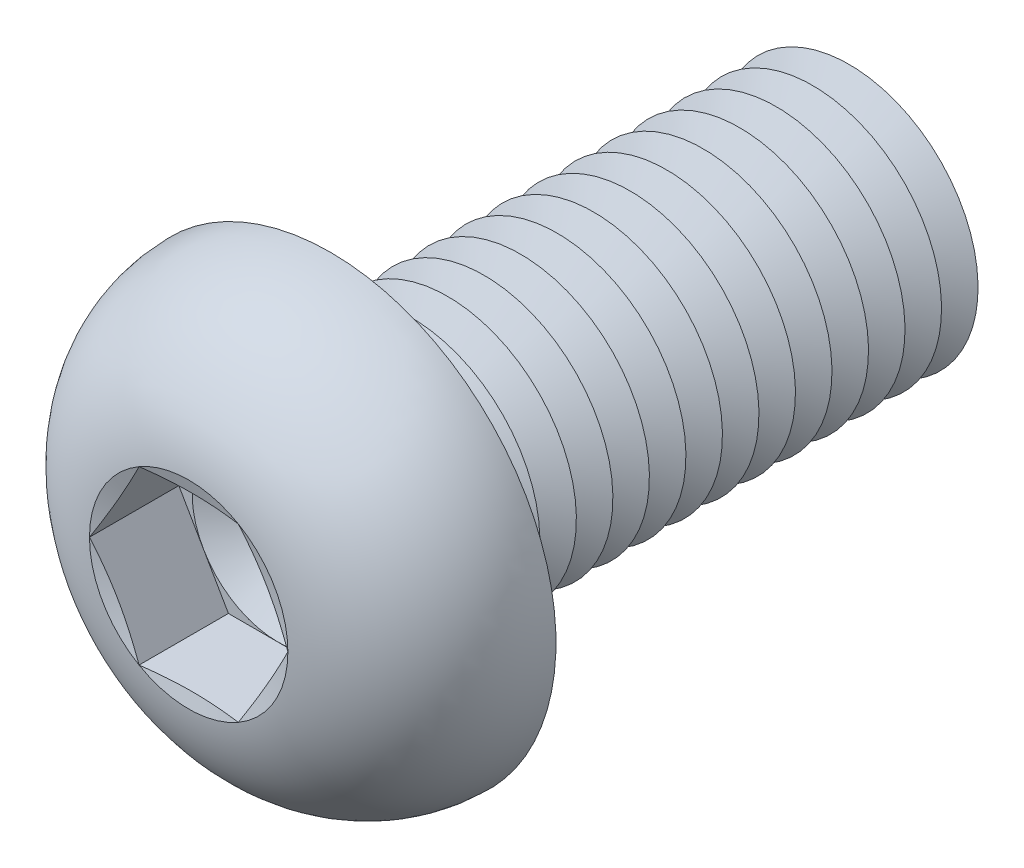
ISO-10303-21;
HEADER;
FILE_DESCRIPTION(('STEP AP214'),'2;1');
FILE_NAME('part.step','',(''),(''),'','','');
FILE_SCHEMA(('AUTOMOTIVE_DESIGN { 1 0 10303 214 1 1 1 1 }'));
ENDSEC;
DATA;
#1=APPLICATION_CONTEXT('core data for automotive mechanical design processes');
#2=APPLICATION_PROTOCOL_DEFINITION('international standard','automotive_design',2000,#1);
#3=PRODUCT_CONTEXT('',#1,'mechanical');
#4=PRODUCT('Part','Part','',(#3));
#5=PRODUCT_RELATED_PRODUCT_CATEGORY('part','',(#4));
#6=PRODUCT_DEFINITION_FORMATION('','',#4);
#7=PRODUCT_DEFINITION_CONTEXT('part definition',#1,'design');
#8=PRODUCT_DEFINITION('design','',#6,#7);
#9=PRODUCT_DEFINITION_SHAPE('','',#8);
#10=(LENGTH_UNIT() NAMED_UNIT(*) SI_UNIT(.MILLI.,.METRE.));
#11=(NAMED_UNIT(*) PLANE_ANGLE_UNIT() SI_UNIT($,.RADIAN.));
#12=(NAMED_UNIT(*) SI_UNIT($,.STERADIAN.) SOLID_ANGLE_UNIT());
#13=UNCERTAINTY_MEASURE_WITH_UNIT(LENGTH_MEASURE(1.E-05),#10,'distance_accuracy_value','');
#14=(GEOMETRIC_REPRESENTATION_CONTEXT(3) GLOBAL_UNCERTAINTY_ASSIGNED_CONTEXT((#13)) GLOBAL_UNIT_ASSIGNED_CONTEXT((#10,
#11,#12)) REPRESENTATION_CONTEXT('',''));
#15=CARTESIAN_POINT('',(0.,0.,0.));
#16=DIRECTION('',(0.,0.,1.));
#17=DIRECTION('',(1.,0.,0.));
#18=AXIS2_PLACEMENT_3D('',#15,#16,#17);
#19=CARTESIAN_POINT('',(0.,0.,2.43999999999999));
#20=DIRECTION('',(0.,0.,1.));
#21=DIRECTION('',(1.,0.,0.));
#22=AXIS2_PLACEMENT_3D('',#19,#20,#21);
#23=PLANE('',#22);
#24=CARTESIAN_POINT('',(0.,0.,2.43999999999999));
#25=DIRECTION('',(0.,0.,1.));
#26=DIRECTION('',(1.,0.,0.));
#27=AXIS2_PLACEMENT_3D('',#24,#25,#26);
#28=CIRCLE('',#27,3.99999813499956);
#29=CARTESIAN_POINT('',(3.4641,1.99999906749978,2.43999999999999));
#30=VERTEX_POINT('',#29);
#31=CARTESIAN_POINT('',(0.,3.99999813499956,2.43999999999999));
#32=VERTEX_POINT('',#31);
#33=EDGE_CURVE('E118',#30,#32,#28,.T.);
#34=ORIENTED_EDGE('',*,*,#33,.F.);
#35=DIRECTION('',(-0.5,0.866025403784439,0.));
#36=VECTOR('',#35,1.);
#37=CARTESIAN_POINT('',(4.6188,0.,2.43999999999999));
#38=LINE('',#37,#36);
#39=CARTESIAN_POINT('',(2.3094,3.99999813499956,2.43999999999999));
#40=VERTEX_POINT('',#39);
#41=EDGE_CURVE('E125',#30,#40,#38,.T.);
#42=ORIENTED_EDGE('',*,*,#41,.T.);
#43=DIRECTION('',(-1.,0.,0.));
#44=VECTOR('',#43,1.);
#45=CARTESIAN_POINT('',(2.3094,3.99999813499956,2.43999999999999));
#46=LINE('',#45,#44);
#47=EDGE_CURVE('E136',#40,#32,#46,.T.);
#48=ORIENTED_EDGE('',*,*,#47,.T.);
#49=EDGE_LOOP('',(#34,#42,#48));
#50=FACE_BOUND('',#49,.T.);
#51=ADVANCED_FACE('F39',(#50),#23,.T.);
#52=CARTESIAN_POINT('',(0.,0.,2.43999999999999));
#53=DIRECTION('',(0.,0.,1.));
#54=DIRECTION('',(1.,0.,0.));
#55=AXIS2_PLACEMENT_3D('',#52,#53,#54);
#56=CIRCLE('',#55,3.99999813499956);
#57=CARTESIAN_POINT('',(-3.4641,1.99999906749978,2.43999999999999));
#58=VERTEX_POINT('',#57);
#59=EDGE_CURVE('E11',#32,#58,#56,.T.);
#60=ORIENTED_EDGE('',*,*,#59,.F.);
#61=CARTESIAN_POINT('',(-2.3094,3.99999813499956,2.43999999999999));
#62=VERTEX_POINT('',#61);
#63=EDGE_CURVE('E131',#32,#62,#46,.T.);
#64=ORIENTED_EDGE('',*,*,#63,.T.);
#65=DIRECTION('',(-0.5,-0.866025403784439,0.));
#66=VECTOR('',#65,1.);
#67=CARTESIAN_POINT('',(-2.3094,3.99999813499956,2.43999999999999));
#68=LINE('',#67,#66);
#69=EDGE_CURVE('E134',#62,#58,#68,.T.);
#70=ORIENTED_EDGE('',*,*,#69,.T.);
#71=EDGE_LOOP('',(#60,#64,#70));
#72=FACE_BOUND('',#71,.T.);
#73=ADVANCED_FACE('F130',(#72),#23,.T.);
#74=CARTESIAN_POINT('',(-3.4641,-1.99999906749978,2.43999999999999));
#75=VERTEX_POINT('',#74);
#76=EDGE_CURVE('E49',#58,#75,#56,.T.);
#77=ORIENTED_EDGE('',*,*,#76,.F.);
#78=CARTESIAN_POINT('',(-4.6188,0.,2.43999999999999));
#79=VERTEX_POINT('',#78);
#80=EDGE_CURVE('E143',#58,#79,#68,.T.);
#81=ORIENTED_EDGE('',*,*,#80,.T.);
#82=DIRECTION('',(0.5,-0.866025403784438,0.));
#83=VECTOR('',#82,1.);
#84=CARTESIAN_POINT('',(-4.6188,0.,2.43999999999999));
#85=LINE('',#84,#83);
#86=EDGE_CURVE('E152',#79,#75,#85,.T.);
#87=ORIENTED_EDGE('',*,*,#86,.T.);
#88=EDGE_LOOP('',(#77,#81,#87));
#89=FACE_BOUND('',#88,.T.);
#90=ADVANCED_FACE('F385',(#89),#23,.T.);
#91=CARTESIAN_POINT('',(0.,-3.99999813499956,2.43999999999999));
#92=VERTEX_POINT('',#91);
#93=EDGE_CURVE('E371',#75,#92,#56,.T.);
#94=ORIENTED_EDGE('',*,*,#93,.F.);
#95=CARTESIAN_POINT('',(-2.3094,-3.99999813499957,2.43999999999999));
#96=VERTEX_POINT('',#95);
#97=EDGE_CURVE('E151',#75,#96,#85,.T.);
#98=ORIENTED_EDGE('',*,*,#97,.T.);
#99=DIRECTION('',(1.,0.,0.));
#100=VECTOR('',#99,1.);
#101=CARTESIAN_POINT('',(-2.3094,-3.99999813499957,2.43999999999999));
#102=LINE('',#101,#100);
#103=EDGE_CURVE('E157',#96,#92,#102,.T.);
#104=ORIENTED_EDGE('',*,*,#103,.T.);
#105=EDGE_LOOP('',(#94,#98,#104));
#106=FACE_BOUND('',#105,.T.);
#107=ADVANCED_FACE('F379',(#106),#23,.T.);
#108=CARTESIAN_POINT('',(3.4641,-1.99999906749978,2.43999999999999));
#109=VERTEX_POINT('',#108);
#110=EDGE_CURVE('E56',#92,#109,#56,.T.);
#111=ORIENTED_EDGE('',*,*,#110,.F.);
#112=CARTESIAN_POINT('',(2.3094,-3.99999813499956,2.43999999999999));
#113=VERTEX_POINT('',#112);
#114=EDGE_CURVE('E156',#92,#113,#102,.T.);
#115=ORIENTED_EDGE('',*,*,#114,.T.);
#116=DIRECTION('',(0.5,0.866025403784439,0.));
#117=VECTOR('',#116,1.);
#118=CARTESIAN_POINT('',(2.3094,-3.99999813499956,2.43999999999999));
#119=LINE('',#118,#117);
#120=EDGE_CURVE('E162',#113,#109,#119,.T.);
#121=ORIENTED_EDGE('',*,*,#120,.T.);
#122=EDGE_LOOP('',(#111,#115,#121));
#123=FACE_BOUND('',#122,.T.);
#124=ADVANCED_FACE('F454',(#123),#23,.T.);
#125=CARTESIAN_POINT('',(0.,0.,6.59999999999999));
#126=DIRECTION('',(0.,0.,1.));
#127=DIRECTION('',(0.,-1.,0.));
#128=AXIS2_PLACEMENT_3D('',#125,#126,#127);
#129=CONICAL_SURFACE('',#128,4.6188,1.30899693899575);
#130=CARTESIAN_POINT('',(4.61891547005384,-0.000199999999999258,6.60003094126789));
#131=CARTESIAN_POINT('',(4.52300232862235,0.165926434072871,6.57431944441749));
#132=CARTESIAN_POINT('',(4.42691527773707,0.332354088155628,6.55097758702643));
#133=CARTESIAN_POINT('',(4.23440181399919,0.665797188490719,6.50996805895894));
#134=CARTESIAN_POINT('',(4.13797527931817,0.832812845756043,6.49230269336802));
#135=CARTESIAN_POINT('',(3.94536752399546,1.16641926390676,6.46367750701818));
#136=CARTESIAN_POINT('',(3.84918760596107,1.33300776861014,6.45268354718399));
#137=CARTESIAN_POINT('',(3.6567051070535,1.66639723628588,6.4379417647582));
#138=CARTESIAN_POINT('',(3.56040255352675,1.83319815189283,6.43419253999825));
#139=CARTESIAN_POINT('',(3.36779744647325,2.16679998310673,6.43419253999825));
#140=CARTESIAN_POINT('',(3.2714948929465,2.33360089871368,6.4379417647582));
#141=CARTESIAN_POINT('',(3.07901239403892,2.66699036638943,6.45268354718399));
#142=CARTESIAN_POINT('',(2.98283247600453,2.8335788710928,6.46367750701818));
#143=CARTESIAN_POINT('',(2.79022472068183,3.16718528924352,6.49230269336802));
#144=CARTESIAN_POINT('',(2.69379818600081,3.33420094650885,6.50996805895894));
#145=CARTESIAN_POINT('',(2.50128472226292,3.66764404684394,6.55097758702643));
#146=CARTESIAN_POINT('',(2.40519767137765,3.83407170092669,6.57431944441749));
#147=CARTESIAN_POINT('',(2.30928452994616,4.00019813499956,6.60003094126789));
#148=B_SPLINE_CURVE_WITH_KNOTS('',3,(#130,#131,#132,#133,#134,#135,#136,#137,#138,#139,#140,
#141,#142,#143,#144,#145,#146,#147),.UNSPECIFIED.,.F.,.F.,(4,2,2,2,2,2,2,2,4),(0.,
0.580655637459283,1.16154676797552,1.73943971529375,2.31722080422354,2.89500189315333,
3.47289484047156,4.05378597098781,4.63444160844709),.UNSPECIFIED.);
#149=CARTESIAN_POINT('',(4.6188,0.,6.59999999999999));
#150=VERTEX_POINT('',#149);
#151=CARTESIAN_POINT('',(2.3094,3.99999813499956,6.59999999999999));
#152=VERTEX_POINT('',#151);
#153=EDGE_CURVE('E222',#150,#152,#148,.T.);
#154=ORIENTED_EDGE('',*,*,#153,.F.);
#155=CARTESIAN_POINT('',(0.,0.,6.59999999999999));
#156=DIRECTION('',(0.,0.,-1.));
#157=DIRECTION('',(0.,1.,0.));
#158=AXIS2_PLACEMENT_3D('',#155,#156,#157);
#159=CIRCLE('',#158,4.6188);
#160=EDGE_CURVE('E350',#152,#150,#159,.T.);
#161=ORIENTED_EDGE('',*,*,#160,.F.);
#162=EDGE_LOOP('',(#154,#161));
#163=FACE_BOUND('',#162,.T.);
#164=ADVANCED_FACE('F458',(#163),#129,.F.);
#165=CARTESIAN_POINT('',(2.30928452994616,-4.00019813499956,6.60003094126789));
#166=CARTESIAN_POINT('',(2.40519767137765,-3.83407170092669,6.57431944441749));
#167=CARTESIAN_POINT('',(2.50128472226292,-3.66764404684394,6.55097758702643));
#168=CARTESIAN_POINT('',(2.69379818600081,-3.33420094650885,6.50996805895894));
#169=CARTESIAN_POINT('',(2.79022472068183,-3.16718528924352,6.49230269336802));
#170=CARTESIAN_POINT('',(2.98283247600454,-2.8335788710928,6.46367750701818));
#171=CARTESIAN_POINT('',(3.07901239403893,-2.66699036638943,6.45268354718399));
#172=CARTESIAN_POINT('',(3.2714948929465,-2.33360089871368,6.4379417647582));
#173=CARTESIAN_POINT('',(3.36779744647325,-2.16679998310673,6.43419253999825));
#174=CARTESIAN_POINT('',(3.56040255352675,-1.83319815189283,6.43419253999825));
#175=CARTESIAN_POINT('',(3.6567051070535,-1.66639723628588,6.43794176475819));
#176=CARTESIAN_POINT('',(3.84918760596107,-1.33300776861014,6.45268354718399));
#177=CARTESIAN_POINT('',(3.94536752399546,-1.16641926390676,6.46367750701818));
#178=CARTESIAN_POINT('',(4.13797527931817,-0.832812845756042,6.49230269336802));
#179=CARTESIAN_POINT('',(4.23440181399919,-0.665797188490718,6.50996805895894));
#180=CARTESIAN_POINT('',(4.42691527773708,-0.332354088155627,6.55097758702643));
#181=CARTESIAN_POINT('',(4.52300232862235,-0.16592643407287,6.57431944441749));
#182=CARTESIAN_POINT('',(4.61891547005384,0.000200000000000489,6.60003094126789));
#183=B_SPLINE_CURVE_WITH_KNOTS('',3,(#165,#166,#167,#168,#169,#170,#171,#172,#173,#174,#175,
#176,#177,#178,#179,#180,#181,#182),.UNSPECIFIED.,.F.,.F.,(4,2,2,2,2,2,2,2,4),(0.,
0.580655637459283,1.16154676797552,1.73943971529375,2.31722080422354,2.89500189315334,
3.47289484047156,4.05378597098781,4.63444160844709),.UNSPECIFIED.);
#184=CARTESIAN_POINT('',(2.3094,-3.99999813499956,6.59999999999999));
#185=VERTEX_POINT('',#184);
#186=EDGE_CURVE('E231',#185,#150,#183,.T.);
#187=ORIENTED_EDGE('',*,*,#186,.F.);
#188=EDGE_CURVE('E355',#150,#185,#159,.T.);
#189=ORIENTED_EDGE('',*,*,#188,.F.);
#190=EDGE_LOOP('',(#187,#189));
#191=FACE_BOUND('',#190,.T.);
#192=ADVANCED_FACE('F420',(#191),#129,.F.);
#193=CARTESIAN_POINT('',(-6.96966750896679,-3.99999813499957,7.51561854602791));
#194=CARTESIAN_POINT('',(-6.80094634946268,-3.99999813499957,7.4764117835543));
#195=CARTESIAN_POINT('',(-6.63214895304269,-3.99999813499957,7.43753277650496));
#196=CARTESIAN_POINT('',(-6.29436999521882,-3.99999813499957,7.36057075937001));
#197=CARTESIAN_POINT('',(-6.12538843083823,-3.99999813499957,7.32248776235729));
#198=CARTESIAN_POINT('',(-5.61806276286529,-3.99999813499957,7.20963087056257));
#199=CARTESIAN_POINT('',(-5.27940301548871,-3.99999813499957,7.1362643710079));
#200=CARTESIAN_POINT('',(-4.5977576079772,-3.99999813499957,6.99431141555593));
#201=CARTESIAN_POINT('',(-4.25476115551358,-3.99999813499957,6.92577621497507));
#202=CARTESIAN_POINT('',(-3.56716783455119,-3.99999813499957,6.79696563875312));
#203=CARTESIAN_POINT('',(-3.22257082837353,-3.99999813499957,6.73669098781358));
#204=CARTESIAN_POINT('',(-2.54069952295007,-3.99999813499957,6.63002020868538));
#205=CARTESIAN_POINT('',(-2.20347918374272,-3.99999813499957,6.58329286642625));
#206=CARTESIAN_POINT('',(-1.6962445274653,-3.99999813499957,6.52585827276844));
#207=CARTESIAN_POINT('',(-1.52694760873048,-3.99999813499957,6.50882377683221));
#208=CARTESIAN_POINT('',(-1.187938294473,-3.99999813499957,6.47963274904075));
#209=CARTESIAN_POINT('',(-1.01822592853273,-3.99999813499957,6.4674758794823));
#210=CARTESIAN_POINT('',(-0.679233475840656,-3.99999813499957,6.44863176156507));
#211=CARTESIAN_POINT('',(-0.509954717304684,-3.99999813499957,6.44192096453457));
#212=CARTESIAN_POINT('',(-0.171265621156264,-3.99999813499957,6.43422163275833));
#213=CARTESIAN_POINT('',(-0.00185528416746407,-3.99999813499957,6.43323307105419));
#214=CARTESIAN_POINT('',(0.336912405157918,-3.99999813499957,6.43703123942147));
#215=CARTESIAN_POINT('',(0.506269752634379,-3.99999813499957,6.44181839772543));
#216=CARTESIAN_POINT('',(0.844732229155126,-3.99999813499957,6.45691823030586));
#217=CARTESIAN_POINT('',(1.01383735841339,-3.99999813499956,6.46723089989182));
#218=CARTESIAN_POINT('',(1.42449950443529,-3.99999813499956,6.49843349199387));
#219=CARTESIAN_POINT('',(1.66585565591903,-3.99999813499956,6.52196685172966));
#220=CARTESIAN_POINT('',(2.14755410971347,-3.99999813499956,6.57749710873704));
#221=CARTESIAN_POINT('',(2.3878964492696,-3.99999813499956,6.60949369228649));
#222=CARTESIAN_POINT('',(2.86835569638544,-3.99999813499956,6.68017769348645));
#223=CARTESIAN_POINT('',(3.10846949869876,-3.99999813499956,6.71888590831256));
#224=CARTESIAN_POINT('',(3.58783416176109,-3.99999813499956,6.80132981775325));
#225=CARTESIAN_POINT('',(3.82708497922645,-3.99999813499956,6.84506576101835));
#226=CARTESIAN_POINT('',(4.30977392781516,-3.99999813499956,6.93726543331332));
#227=CARTESIAN_POINT('',(4.55319689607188,-3.99999813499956,6.98580793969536));
#228=CARTESIAN_POINT('',(5.03943022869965,-3.99999813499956,7.085866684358));
#229=CARTESIAN_POINT('',(5.28224058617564,-3.99999813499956,7.13738295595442));
#230=CARTESIAN_POINT('',(5.76604885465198,-3.99999813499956,7.24238429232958));
#231=CARTESIAN_POINT('',(6.00704943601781,-3.99999813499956,7.29585711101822));
#232=CARTESIAN_POINT('',(6.48863948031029,-3.99999813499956,7.40454827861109));
#233=CARTESIAN_POINT('',(6.72922897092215,-3.99999813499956,7.45976650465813));
#234=CARTESIAN_POINT('',(6.9696675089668,-3.99999813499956,7.51561854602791));
#235=B_SPLINE_CURVE_WITH_KNOTS('',3,(#193,#194,#195,#196,#197,#198,#199,#200,#201,#202,#203,
#204,#205,#206,#207,#208,#209,#210,#211,#212,#213,#214,#215,#216,#217,#218,#219,#220,#221,#222,
#223,#224,#225,#226,#227,#228,#229,#230,#231,#232,#233,#234),.UNSPECIFIED.,.F.,.F.,(4,2,2,2,2,2,
2,2,2,2,2,2,2,2,2,2,2,2,2,2,4),(0.,0.51964933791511,1.03930720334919,2.07882421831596,
3.12808572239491,4.17743921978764,5.19841727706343,5.7088142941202,6.21917596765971,
6.72731891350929,7.23545946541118,7.74363769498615,8.25181549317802,8.97911831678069,
9.70639418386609,10.435965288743,11.1655724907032,11.910195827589,12.6548275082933,
13.395405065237,14.1359306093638),.UNSPECIFIED.);
#236=CARTESIAN_POINT('',(-2.3094,-3.99999813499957,6.59999999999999));
#237=VERTEX_POINT('',#236);
#238=EDGE_CURVE('E399',#237,#185,#235,.T.);
#239=ORIENTED_EDGE('',*,*,#238,.F.);
#240=EDGE_CURVE('E412',#185,#237,#159,.T.);
#241=ORIENTED_EDGE('',*,*,#240,.F.);
#242=EDGE_LOOP('',(#239,#241));
#243=FACE_BOUND('',#242,.T.);
#244=ADVANCED_FACE('F426',(#243),#129,.F.);
#245=CARTESIAN_POINT('',(-4.61891547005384,0.000199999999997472,6.60003094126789));
#246=CARTESIAN_POINT('',(-4.52300232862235,-0.165926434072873,6.57431944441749));
#247=CARTESIAN_POINT('',(-4.42691527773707,-0.33235408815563,6.55097758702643));
#248=CARTESIAN_POINT('',(-4.23440181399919,-0.665797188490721,6.50996805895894));
#249=CARTESIAN_POINT('',(-4.13797527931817,-0.832812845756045,6.49230269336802));
#250=CARTESIAN_POINT('',(-3.94536752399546,-1.16641926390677,6.46367750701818));
#251=CARTESIAN_POINT('',(-3.84918760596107,-1.33300776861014,6.45268354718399));
#252=CARTESIAN_POINT('',(-3.6567051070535,-1.66639723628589,6.4379417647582));
#253=CARTESIAN_POINT('',(-3.56040255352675,-1.83319815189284,6.43419253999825));
#254=CARTESIAN_POINT('',(-3.36779744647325,-2.16679998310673,6.43419253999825));
#255=CARTESIAN_POINT('',(-3.2714948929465,-2.33360089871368,6.4379417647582));
#256=CARTESIAN_POINT('',(-3.07901239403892,-2.66699036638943,6.45268354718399));
#257=CARTESIAN_POINT('',(-2.98283247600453,-2.8335788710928,6.46367750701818));
#258=CARTESIAN_POINT('',(-2.79022472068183,-3.16718528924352,6.49230269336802));
#259=CARTESIAN_POINT('',(-2.69379818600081,-3.33420094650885,6.50996805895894));
#260=CARTESIAN_POINT('',(-2.50128472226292,-3.66764404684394,6.55097758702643));
#261=CARTESIAN_POINT('',(-2.40519767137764,-3.8340717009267,6.57431944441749));
#262=CARTESIAN_POINT('',(-2.30928452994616,-4.00019813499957,6.60003094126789));
#263=B_SPLINE_CURVE_WITH_KNOTS('',3,(#245,#246,#247,#248,#249,#250,#251,#252,#253,#254,#255,
#256,#257,#258,#259,#260,#261,#262),.UNSPECIFIED.,.F.,.F.,(4,2,2,2,2,2,2,2,4),(0.,
0.580655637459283,1.16154676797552,1.73943971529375,2.31722080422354,2.89500189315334,
3.47289484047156,4.05378597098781,4.63444160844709),.UNSPECIFIED.);
#264=CARTESIAN_POINT('',(-4.6188,0.,6.59999999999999));
#265=VERTEX_POINT('',#264);
#266=EDGE_CURVE('E390',#265,#237,#263,.T.);
#267=ORIENTED_EDGE('',*,*,#266,.F.);
#268=EDGE_CURVE('E396',#237,#265,#159,.T.);
#269=ORIENTED_EDGE('',*,*,#268,.F.);
#270=EDGE_LOOP('',(#267,#269));
#271=FACE_BOUND('',#270,.T.);
#272=ADVANCED_FACE('F394',(#271),#129,.F.);
#273=CARTESIAN_POINT('',(-2.30928452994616,4.00019813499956,6.60003094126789));
#274=CARTESIAN_POINT('',(-2.40519767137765,3.83407170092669,6.57431944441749));
#275=CARTESIAN_POINT('',(-2.50128472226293,3.66764404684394,6.55097758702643));
#276=CARTESIAN_POINT('',(-2.69379818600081,3.33420094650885,6.50996805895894));
#277=CARTESIAN_POINT('',(-2.79022472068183,3.16718528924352,6.49230269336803));
#278=CARTESIAN_POINT('',(-2.98283247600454,2.8335788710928,6.46367750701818));
#279=CARTESIAN_POINT('',(-3.07901239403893,2.66699036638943,6.45268354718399));
#280=CARTESIAN_POINT('',(-3.2714948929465,2.33360089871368,6.4379417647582));
#281=CARTESIAN_POINT('',(-3.36779744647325,2.16679998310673,6.43419253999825));
#282=CARTESIAN_POINT('',(-3.56040255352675,1.83319815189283,6.43419253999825));
#283=CARTESIAN_POINT('',(-3.6567051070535,1.66639723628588,6.43794176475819));
#284=CARTESIAN_POINT('',(-3.84918760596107,1.33300776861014,6.45268354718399));
#285=CARTESIAN_POINT('',(-3.94536752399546,1.16641926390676,6.46367750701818));
#286=CARTESIAN_POINT('',(-4.13797527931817,0.832812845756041,6.49230269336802));
#287=CARTESIAN_POINT('',(-4.23440181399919,0.665797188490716,6.50996805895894));
#288=CARTESIAN_POINT('',(-4.42691527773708,0.332354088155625,6.55097758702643));
#289=CARTESIAN_POINT('',(-4.52300232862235,0.165926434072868,6.57431944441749));
#290=CARTESIAN_POINT('',(-4.61891547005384,-0.000200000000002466,6.60003094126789));
#291=B_SPLINE_CURVE_WITH_KNOTS('',3,(#273,#274,#275,#276,#277,#278,#279,#280,#281,#282,#283,
#284,#285,#286,#287,#288,#289,#290),.UNSPECIFIED.,.F.,.F.,(4,2,2,2,2,2,2,2,4),(0.,
0.580655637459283,1.16154676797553,1.73943971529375,2.31722080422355,2.89500189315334,
3.47289484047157,4.05378597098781,4.63444160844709),.UNSPECIFIED.);
#292=CARTESIAN_POINT('',(-2.3094,3.99999813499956,6.59999999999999));
#293=VERTEX_POINT('',#292);
#294=EDGE_CURVE('E195',#293,#265,#291,.T.);
#295=ORIENTED_EDGE('',*,*,#294,.F.);
#296=EDGE_CURVE('E402',#265,#293,#159,.T.);
#297=ORIENTED_EDGE('',*,*,#296,.F.);
#298=EDGE_LOOP('',(#295,#297));
#299=FACE_BOUND('',#298,.T.);
#300=ADVANCED_FACE('F403',(#299),#129,.F.);
#301=CARTESIAN_POINT('',(0.,0.,-19.05));
#302=DIRECTION('',(0.,0.,1.));
#303=DIRECTION('',(0.,-1.,0.));
#304=AXIS2_PLACEMENT_3D('',#301,#302,#303);
#305=CONICAL_SURFACE('',#304,6.,1.0471975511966);
#306=CARTESIAN_POINT('',(0.,0.,-19.9));
#307=DIRECTION('',(0.,0.,1.));
#308=DIRECTION('',(0.,-1.,0.));
#309=AXIS2_PLACEMENT_3D('',#306,#307,#308);
#310=CIRCLE('',#309,4.52775681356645);
#311=CARTESIAN_POINT('',(0.,-4.52775681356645,-19.9));
#312=VERTEX_POINT('',#311);
#313=EDGE_CURVE('E321',#312,#312,#310,.T.);
#314=ORIENTED_EDGE('',*,*,#313,.T.);
#315=EDGE_LOOP('',(#314));
#316=FACE_BOUND('',#315,.T.);
#317=CARTESIAN_POINT('',(0.,0.,-19.05));
#318=DIRECTION('',(0.,0.,1.));
#319=DIRECTION('',(0.,-1.,0.));
#320=AXIS2_PLACEMENT_3D('',#317,#318,#319);
#321=CIRCLE('',#320,6.);
#322=CARTESIAN_POINT('',(0.,-6.,-19.05));
#323=VERTEX_POINT('',#322);
#324=EDGE_CURVE('E317',#323,#323,#321,.T.);
#325=ORIENTED_EDGE('',*,*,#324,.F.);
#326=EDGE_LOOP('',(#325));
#327=FACE_BOUND('',#326,.T.);
#328=ADVANCED_FACE('F486',(#316,#327),#305,.T.);
#329=CARTESIAN_POINT('',(0.,0.,-19.9));
#330=DIRECTION('',(0.,0.,-1.));
#331=DIRECTION('',(0.,1.,0.));
#332=AXIS2_PLACEMENT_3D('',#329,#330,#331);
#333=CONICAL_SURFACE('',#332,4.52775681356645,1.0471975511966);
#334=CARTESIAN_POINT('',(0.,0.,-20.75));
#335=DIRECTION('',(0.,0.,1.));
#336=DIRECTION('',(0.,-1.,0.));
#337=AXIS2_PLACEMENT_3D('',#334,#335,#336);
#338=CIRCLE('',#337,6.);
#339=CARTESIAN_POINT('',(0.,-6.,-20.75));
#340=VERTEX_POINT('',#339);
#341=EDGE_CURVE('E325',#340,#340,#338,.T.);
#342=ORIENTED_EDGE('',*,*,#341,.T.);
#343=EDGE_LOOP('',(#342));
#344=FACE_BOUND('',#343,.T.);
#345=ORIENTED_EDGE('',*,*,#313,.F.);
#346=EDGE_LOOP('',(#345));
#347=FACE_BOUND('',#346,.T.);
#348=ADVANCED_FACE('F491',(#344,#347),#333,.T.);
#349=CARTESIAN_POINT('',(0.,6.00000000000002,-25.));
#350=DIRECTION('',(0.,0.,-1.));
#351=DIRECTION('',(0.,1.,0.));
#352=AXIS2_PLACEMENT_3D('',#349,#350,#351);
#353=PLANE('',#352);
#354=CARTESIAN_POINT('',(0.,0.,-25.));
#355=DIRECTION('',(0.,0.,1.));
#356=DIRECTION('',(0.,-1.,0.));
#357=AXIS2_PLACEMENT_3D('',#354,#355,#356);
#358=CIRCLE('',#357,4.52775681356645);
#359=CARTESIAN_POINT('',(0.,-4.52775681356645,-25.));
#360=VERTEX_POINT('',#359);
#361=EDGE_CURVE('E345',#360,#360,#358,.T.);
#362=ORIENTED_EDGE('',*,*,#361,.F.);
#363=EDGE_LOOP('',(#362));
#364=FACE_BOUND('',#363,.T.);
#365=ADVANCED_FACE('F666',(#364),#353,.T.);
#366=CARTESIAN_POINT('',(0.,0.,-24.15));
#367=DIRECTION('',(0.,0.,1.));
#368=DIRECTION('',(0.,-1.,0.));
#369=AXIS2_PLACEMENT_3D('',#366,#367,#368);
#370=CONICAL_SURFACE('',#369,6.,1.0471975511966);
#371=ORIENTED_EDGE('',*,*,#361,.T.);
#372=EDGE_LOOP('',(#371));
#373=FACE_BOUND('',#372,.T.);
#374=CARTESIAN_POINT('',(0.,0.,-24.15));
#375=DIRECTION('',(0.,0.,1.));
#376=DIRECTION('',(0.,-1.,0.));
#377=AXIS2_PLACEMENT_3D('',#374,#375,#376);
#378=CIRCLE('',#377,6.);
#379=CARTESIAN_POINT('',(0.,-6.,-24.15));
#380=VERTEX_POINT('',#379);
#381=EDGE_CURVE('E341',#380,#380,#378,.T.);
#382=ORIENTED_EDGE('',*,*,#381,.F.);
#383=EDGE_LOOP('',(#382));
#384=FACE_BOUND('',#383,.T.);
#385=ADVANCED_FACE('F659',(#373,#384),#370,.T.);
#386=CARTESIAN_POINT('',(0.,0.,-23.3));
#387=DIRECTION('',(0.,0.,-1.));
#388=DIRECTION('',(0.,1.,0.));
#389=AXIS2_PLACEMENT_3D('',#386,#387,#388);
#390=CONICAL_SURFACE('',#389,4.52775681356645,1.0471975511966);
#391=ORIENTED_EDGE('',*,*,#381,.T.);
#392=EDGE_LOOP('',(#391));
#393=FACE_BOUND('',#392,.T.);
#394=CARTESIAN_POINT('',(0.,0.,-23.3));
#395=DIRECTION('',(0.,0.,1.));
#396=DIRECTION('',(0.,-1.,0.));
#397=AXIS2_PLACEMENT_3D('',#394,#395,#396);
#398=CIRCLE('',#397,4.52775681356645);
#399=CARTESIAN_POINT('',(0.,-4.52775681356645,-23.3));
#400=VERTEX_POINT('',#399);
#401=EDGE_CURVE('E337',#400,#400,#398,.T.);
#402=ORIENTED_EDGE('',*,*,#401,.F.);
#403=EDGE_LOOP('',(#402));
#404=FACE_BOUND('',#403,.T.);
#405=ADVANCED_FACE('F665',(#393,#404),#390,.T.);
#406=CARTESIAN_POINT('',(0.,0.,-22.45));
#407=DIRECTION('',(0.,0.,1.));
#408=DIRECTION('',(0.,-1.,0.));
#409=AXIS2_PLACEMENT_3D('',#406,#407,#408);
#410=CONICAL_SURFACE('',#409,6.,1.0471975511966);
#411=ORIENTED_EDGE('',*,*,#401,.T.);
#412=EDGE_LOOP('',(#411));
#413=FACE_BOUND('',#412,.T.);
#414=CARTESIAN_POINT('',(0.,0.,-22.45));
#415=DIRECTION('',(0.,0.,1.));
#416=DIRECTION('',(0.,-1.,0.));
#417=AXIS2_PLACEMENT_3D('',#414,#415,#416);
#418=CIRCLE('',#417,6.);
#419=CARTESIAN_POINT('',(0.,-6.,-22.45));
#420=VERTEX_POINT('',#419);
#421=EDGE_CURVE('E333',#420,#420,#418,.T.);
#422=ORIENTED_EDGE('',*,*,#421,.F.);
#423=EDGE_LOOP('',(#422));
#424=FACE_BOUND('',#423,.T.);
#425=ADVANCED_FACE('F697',(#413,#424),#410,.T.);
#426=CARTESIAN_POINT('',(0.,0.,-21.6));
#427=DIRECTION('',(0.,0.,-1.));
#428=DIRECTION('',(0.,1.,0.));
#429=AXIS2_PLACEMENT_3D('',#426,#427,#428);
#430=CONICAL_SURFACE('',#429,4.52775681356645,1.0471975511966);
#431=ORIENTED_EDGE('',*,*,#421,.T.);
#432=EDGE_LOOP('',(#431));
#433=FACE_BOUND('',#432,.T.);
#434=CARTESIAN_POINT('',(0.,0.,-21.6));
#435=DIRECTION('',(0.,0.,1.));
#436=DIRECTION('',(0.,-1.,0.));
#437=AXIS2_PLACEMENT_3D('',#434,#435,#436);
#438=CIRCLE('',#437,4.52775681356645);
#439=CARTESIAN_POINT('',(0.,-4.52775681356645,-21.6));
#440=VERTEX_POINT('',#439);
#441=EDGE_CURVE('E329',#440,#440,#438,.T.);
#442=ORIENTED_EDGE('',*,*,#441,.F.);
#443=EDGE_LOOP('',(#442));
#444=FACE_BOUND('',#443,.T.);
#445=ADVANCED_FACE('F707',(#433,#444),#430,.T.);
#446=CARTESIAN_POINT('',(0.,0.,-20.75));
#447=DIRECTION('',(0.,0.,1.));
#448=DIRECTION('',(0.,-1.,0.));
#449=AXIS2_PLACEMENT_3D('',#446,#447,#448);
#450=CONICAL_SURFACE('',#449,6.,1.0471975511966);
#451=ORIENTED_EDGE('',*,*,#441,.T.);
#452=EDGE_LOOP('',(#451));
#453=FACE_BOUND('',#452,.T.);
#454=ORIENTED_EDGE('',*,*,#341,.F.);
#455=EDGE_LOOP('',(#454));
#456=FACE_BOUND('',#455,.T.);
#457=ADVANCED_FACE('F717',(#453,#456),#450,.T.);
#458=CARTESIAN_POINT('',(0.,0.,-17.35));
#459=DIRECTION('',(0.,0.,1.));
#460=DIRECTION('',(0.,-1.,0.));
#461=AXIS2_PLACEMENT_3D('',#458,#459,#460);
#462=CONICAL_SURFACE('',#461,6.,1.0471975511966);
#463=CARTESIAN_POINT('',(0.,0.,-18.2));
#464=DIRECTION('',(0.,0.,1.));
#465=DIRECTION('',(0.,-1.,0.));
#466=AXIS2_PLACEMENT_3D('',#463,#464,#465);
#467=CIRCLE('',#466,4.52775681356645);
#468=CARTESIAN_POINT('',(0.,-4.52775681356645,-18.2));
#469=VERTEX_POINT('',#468);
#470=EDGE_CURVE('E313',#469,#469,#467,.T.);
#471=ORIENTED_EDGE('',*,*,#470,.T.);
#472=EDGE_LOOP('',(#471));
#473=FACE_BOUND('',#472,.T.);
#474=CARTESIAN_POINT('',(0.,0.,-17.35));
#475=DIRECTION('',(0.,0.,1.));
#476=DIRECTION('',(0.,-1.,0.));
#477=AXIS2_PLACEMENT_3D('',#474,#475,#476);
#478=CIRCLE('',#477,6.);
#479=CARTESIAN_POINT('',(0.,-6.,-17.35));
#480=VERTEX_POINT('',#479);
#481=EDGE_CURVE('E309',#480,#480,#478,.T.);
#482=ORIENTED_EDGE('',*,*,#481,.F.);
#483=EDGE_LOOP('',(#482));
#484=FACE_BOUND('',#483,.T.);
#485=ADVANCED_FACE('F727',(#473,#484),#462,.T.);
#486=CARTESIAN_POINT('',(0.,0.,-18.2));
#487=DIRECTION('',(0.,0.,-1.));
#488=DIRECTION('',(0.,1.,0.));
#489=AXIS2_PLACEMENT_3D('',#486,#487,#488);
#490=CONICAL_SURFACE('',#489,4.52775681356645,1.0471975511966);
#491=ORIENTED_EDGE('',*,*,#324,.T.);
#492=EDGE_LOOP('',(#491));
#493=FACE_BOUND('',#492,.T.);
#494=ORIENTED_EDGE('',*,*,#470,.F.);
#495=EDGE_LOOP('',(#494));
#496=FACE_BOUND('',#495,.T.);
#497=ADVANCED_FACE('F737',(#493,#496),#490,.T.);
#498=CARTESIAN_POINT('',(0.,0.,-15.65));
#499=DIRECTION('',(0.,0.,1.));
#500=DIRECTION('',(0.,-1.,0.));
#501=AXIS2_PLACEMENT_3D('',#498,#499,#500);
#502=CONICAL_SURFACE('',#501,6.,1.0471975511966);
#503=CARTESIAN_POINT('',(0.,0.,-16.5));
#504=DIRECTION('',(0.,0.,1.));
#505=DIRECTION('',(0.,-1.,0.));
#506=AXIS2_PLACEMENT_3D('',#503,#504,#505);
#507=CIRCLE('',#506,4.52775681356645);
#508=CARTESIAN_POINT('',(0.,-4.52775681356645,-16.5));
#509=VERTEX_POINT('',#508);
#510=EDGE_CURVE('E305',#509,#509,#507,.T.);
#511=ORIENTED_EDGE('',*,*,#510,.T.);
#512=EDGE_LOOP('',(#511));
#513=FACE_BOUND('',#512,.T.);
#514=CARTESIAN_POINT('',(0.,0.,-15.65));
#515=DIRECTION('',(0.,0.,1.));
#516=DIRECTION('',(0.,-1.,0.));
#517=AXIS2_PLACEMENT_3D('',#514,#515,#516);
#518=CIRCLE('',#517,6.);
#519=CARTESIAN_POINT('',(0.,-6.,-15.65));
#520=VERTEX_POINT('',#519);
#521=EDGE_CURVE('E301',#520,#520,#518,.T.);
#522=ORIENTED_EDGE('',*,*,#521,.F.);
#523=EDGE_LOOP('',(#522));
#524=FACE_BOUND('',#523,.T.);
#525=ADVANCED_FACE('F747',(#513,#524),#502,.T.);
#526=CARTESIAN_POINT('',(0.,0.,-16.5));
#527=DIRECTION('',(0.,0.,-1.));
#528=DIRECTION('',(0.,1.,0.));
#529=AXIS2_PLACEMENT_3D('',#526,#527,#528);
#530=CONICAL_SURFACE('',#529,4.52775681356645,1.0471975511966);
#531=ORIENTED_EDGE('',*,*,#481,.T.);
#532=EDGE_LOOP('',(#531));
#533=FACE_BOUND('',#532,.T.);
#534=ORIENTED_EDGE('',*,*,#510,.F.);
#535=EDGE_LOOP('',(#534));
#536=FACE_BOUND('',#535,.T.);
#537=ADVANCED_FACE('F757',(#533,#536),#530,.T.);
#538=CARTESIAN_POINT('',(0.,0.,-13.95));
#539=DIRECTION('',(0.,0.,1.));
#540=DIRECTION('',(0.,-1.,0.));
#541=AXIS2_PLACEMENT_3D('',#538,#539,#540);
#542=CONICAL_SURFACE('',#541,6.,1.0471975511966);
#543=CARTESIAN_POINT('',(0.,0.,-14.8));
#544=DIRECTION('',(0.,0.,1.));
#545=DIRECTION('',(0.,-1.,0.));
#546=AXIS2_PLACEMENT_3D('',#543,#544,#545);
#547=CIRCLE('',#546,4.52775681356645);
#548=CARTESIAN_POINT('',(0.,-4.52775681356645,-14.8));
#549=VERTEX_POINT('',#548);
#550=EDGE_CURVE('E297',#549,#549,#547,.T.);
#551=ORIENTED_EDGE('',*,*,#550,.T.);
#552=EDGE_LOOP('',(#551));
#553=FACE_BOUND('',#552,.T.);
#554=CARTESIAN_POINT('',(0.,0.,-13.95));
#555=DIRECTION('',(0.,0.,1.));
#556=DIRECTION('',(0.,-1.,0.));
#557=AXIS2_PLACEMENT_3D('',#554,#555,#556);
#558=CIRCLE('',#557,6.);
#559=CARTESIAN_POINT('',(0.,-6.,-13.95));
#560=VERTEX_POINT('',#559);
#561=EDGE_CURVE('E293',#560,#560,#558,.T.);
#562=ORIENTED_EDGE('',*,*,#561,.F.);
#563=EDGE_LOOP('',(#562));
#564=FACE_BOUND('',#563,.T.);
#565=ADVANCED_FACE('F767',(#553,#564),#542,.T.);
#566=CARTESIAN_POINT('',(0.,0.,-14.8));
#567=DIRECTION('',(0.,0.,-1.));
#568=DIRECTION('',(0.,1.,0.));
#569=AXIS2_PLACEMENT_3D('',#566,#567,#568);
#570=CONICAL_SURFACE('',#569,4.52775681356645,1.0471975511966);
#571=ORIENTED_EDGE('',*,*,#521,.T.);
#572=EDGE_LOOP('',(#571));
#573=FACE_BOUND('',#572,.T.);
#574=ORIENTED_EDGE('',*,*,#550,.F.);
#575=EDGE_LOOP('',(#574));
#576=FACE_BOUND('',#575,.T.);
#577=ADVANCED_FACE('F777',(#573,#576),#570,.T.);
#578=CARTESIAN_POINT('',(0.,0.,-12.25));
#579=DIRECTION('',(0.,0.,1.));
#580=DIRECTION('',(0.,-1.,0.));
#581=AXIS2_PLACEMENT_3D('',#578,#579,#580);
#582=CONICAL_SURFACE('',#581,6.,1.0471975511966);
#583=CARTESIAN_POINT('',(0.,0.,-13.1));
#584=DIRECTION('',(0.,0.,1.));
#585=DIRECTION('',(0.,-1.,0.));
#586=AXIS2_PLACEMENT_3D('',#583,#584,#585);
#587=CIRCLE('',#586,4.52775681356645);
#588=CARTESIAN_POINT('',(0.,-4.52775681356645,-13.1));
#589=VERTEX_POINT('',#588);
#590=EDGE_CURVE('E289',#589,#589,#587,.T.);
#591=ORIENTED_EDGE('',*,*,#590,.T.);
#592=EDGE_LOOP('',(#591));
#593=FACE_BOUND('',#592,.T.);
#594=CARTESIAN_POINT('',(0.,0.,-12.25));
#595=DIRECTION('',(0.,0.,1.));
#596=DIRECTION('',(0.,-1.,0.));
#597=AXIS2_PLACEMENT_3D('',#594,#595,#596);
#598=CIRCLE('',#597,6.);
#599=CARTESIAN_POINT('',(0.,-6.,-12.25));
#600=VERTEX_POINT('',#599);
#601=EDGE_CURVE('E285',#600,#600,#598,.T.);
#602=ORIENTED_EDGE('',*,*,#601,.F.);
#603=EDGE_LOOP('',(#602));
#604=FACE_BOUND('',#603,.T.);
#605=ADVANCED_FACE('F787',(#593,#604),#582,.T.);
#606=CARTESIAN_POINT('',(0.,0.,-13.1));
#607=DIRECTION('',(0.,0.,-1.));
#608=DIRECTION('',(0.,1.,0.));
#609=AXIS2_PLACEMENT_3D('',#606,#607,#608);
#610=CONICAL_SURFACE('',#609,4.52775681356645,1.0471975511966);
#611=ORIENTED_EDGE('',*,*,#561,.T.);
#612=EDGE_LOOP('',(#611));
#613=FACE_BOUND('',#612,.T.);
#614=ORIENTED_EDGE('',*,*,#590,.F.);
#615=EDGE_LOOP('',(#614));
#616=FACE_BOUND('',#615,.T.);
#617=ADVANCED_FACE('F797',(#613,#616),#610,.T.);
#618=CARTESIAN_POINT('',(0.,0.,-10.55));
#619=DIRECTION('',(0.,0.,1.));
#620=DIRECTION('',(0.,-1.,0.));
#621=AXIS2_PLACEMENT_3D('',#618,#619,#620);
#622=CONICAL_SURFACE('',#621,6.,1.0471975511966);
#623=CARTESIAN_POINT('',(0.,0.,-11.4));
#624=DIRECTION('',(0.,0.,1.));
#625=DIRECTION('',(0.,-1.,0.));
#626=AXIS2_PLACEMENT_3D('',#623,#624,#625);
#627=CIRCLE('',#626,4.52775681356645);
#628=CARTESIAN_POINT('',(0.,-4.52775681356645,-11.4));
#629=VERTEX_POINT('',#628);
#630=EDGE_CURVE('E281',#629,#629,#627,.T.);
#631=ORIENTED_EDGE('',*,*,#630,.T.);
#632=EDGE_LOOP('',(#631));
#633=FACE_BOUND('',#632,.T.);
#634=CARTESIAN_POINT('',(0.,0.,-10.55));
#635=DIRECTION('',(0.,0.,1.));
#636=DIRECTION('',(0.,-1.,0.));
#637=AXIS2_PLACEMENT_3D('',#634,#635,#636);
#638=CIRCLE('',#637,6.);
#639=CARTESIAN_POINT('',(0.,-6.,-10.55));
#640=VERTEX_POINT('',#639);
#641=EDGE_CURVE('E277',#640,#640,#638,.T.);
#642=ORIENTED_EDGE('',*,*,#641,.F.);
#643=EDGE_LOOP('',(#642));
#644=FACE_BOUND('',#643,.T.);
#645=ADVANCED_FACE('F807',(#633,#644),#622,.T.);
#646=CARTESIAN_POINT('',(0.,0.,-11.4));
#647=DIRECTION('',(0.,0.,-1.));
#648=DIRECTION('',(0.,1.,0.));
#649=AXIS2_PLACEMENT_3D('',#646,#647,#648);
#650=CONICAL_SURFACE('',#649,4.52775681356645,1.0471975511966);
#651=ORIENTED_EDGE('',*,*,#601,.T.);
#652=EDGE_LOOP('',(#651));
#653=FACE_BOUND('',#652,.T.);
#654=ORIENTED_EDGE('',*,*,#630,.F.);
#655=EDGE_LOOP('',(#654));
#656=FACE_BOUND('',#655,.T.);
#657=ADVANCED_FACE('F817',(#653,#656),#650,.T.);
#658=CARTESIAN_POINT('',(0.,0.,-8.85));
#659=DIRECTION('',(0.,0.,1.));
#660=DIRECTION('',(0.,-1.,0.));
#661=AXIS2_PLACEMENT_3D('',#658,#659,#660);
#662=CONICAL_SURFACE('',#661,6.,1.0471975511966);
#663=CARTESIAN_POINT('',(0.,0.,-9.7));
#664=DIRECTION('',(0.,0.,1.));
#665=DIRECTION('',(0.,-1.,0.));
#666=AXIS2_PLACEMENT_3D('',#663,#664,#665);
#667=CIRCLE('',#666,4.52775681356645);
#668=CARTESIAN_POINT('',(0.,-4.52775681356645,-9.7));
#669=VERTEX_POINT('',#668);
#670=EDGE_CURVE('E273',#669,#669,#667,.T.);
#671=ORIENTED_EDGE('',*,*,#670,.T.);
#672=EDGE_LOOP('',(#671));
#673=FACE_BOUND('',#672,.T.);
#674=CARTESIAN_POINT('',(0.,0.,-8.85));
#675=DIRECTION('',(0.,0.,1.));
#676=DIRECTION('',(0.,-1.,0.));
#677=AXIS2_PLACEMENT_3D('',#674,#675,#676);
#678=CIRCLE('',#677,6.);
#679=CARTESIAN_POINT('',(0.,-6.,-8.85));
#680=VERTEX_POINT('',#679);
#681=EDGE_CURVE('E269',#680,#680,#678,.T.);
#682=ORIENTED_EDGE('',*,*,#681,.F.);
#683=EDGE_LOOP('',(#682));
#684=FACE_BOUND('',#683,.T.);
#685=ADVANCED_FACE('F827',(#673,#684),#662,.T.);
#686=CARTESIAN_POINT('',(0.,0.,-9.7));
#687=DIRECTION('',(0.,0.,-1.));
#688=DIRECTION('',(0.,1.,0.));
#689=AXIS2_PLACEMENT_3D('',#686,#687,#688);
#690=CONICAL_SURFACE('',#689,4.52775681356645,1.0471975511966);
#691=ORIENTED_EDGE('',*,*,#641,.T.);
#692=EDGE_LOOP('',(#691));
#693=FACE_BOUND('',#692,.T.);
#694=ORIENTED_EDGE('',*,*,#670,.F.);
#695=EDGE_LOOP('',(#694));
#696=FACE_BOUND('',#695,.T.);
#697=ADVANCED_FACE('F837',(#693,#696),#690,.T.);
#698=CARTESIAN_POINT('',(0.,0.,-7.15));
#699=DIRECTION('',(0.,0.,1.));
#700=DIRECTION('',(0.,-1.,0.));
#701=AXIS2_PLACEMENT_3D('',#698,#699,#700);
#702=CONICAL_SURFACE('',#701,6.,1.0471975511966);
#703=CARTESIAN_POINT('',(0.,0.,-8.));
#704=DIRECTION('',(0.,0.,1.));
#705=DIRECTION('',(0.,-1.,0.));
#706=AXIS2_PLACEMENT_3D('',#703,#704,#705);
#707=CIRCLE('',#706,4.52775681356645);
#708=CARTESIAN_POINT('',(0.,-4.52775681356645,-8.));
#709=VERTEX_POINT('',#708);
#710=EDGE_CURVE('E265',#709,#709,#707,.T.);
#711=ORIENTED_EDGE('',*,*,#710,.T.);
#712=EDGE_LOOP('',(#711));
#713=FACE_BOUND('',#712,.T.);
#714=CARTESIAN_POINT('',(0.,0.,-7.15));
#715=DIRECTION('',(0.,0.,1.));
#716=DIRECTION('',(0.,-1.,0.));
#717=AXIS2_PLACEMENT_3D('',#714,#715,#716);
#718=CIRCLE('',#717,6.);
#719=CARTESIAN_POINT('',(0.,-6.,-7.15));
#720=VERTEX_POINT('',#719);
#721=EDGE_CURVE('E261',#720,#720,#718,.T.);
#722=ORIENTED_EDGE('',*,*,#721,.F.);
#723=EDGE_LOOP('',(#722));
#724=FACE_BOUND('',#723,.T.);
#725=ADVANCED_FACE('F847',(#713,#724),#702,.T.);
#726=CARTESIAN_POINT('',(0.,0.,-8.));
#727=DIRECTION('',(0.,0.,-1.));
#728=DIRECTION('',(0.,1.,0.));
#729=AXIS2_PLACEMENT_3D('',#726,#727,#728);
#730=CONICAL_SURFACE('',#729,4.52775681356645,1.0471975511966);
#731=ORIENTED_EDGE('',*,*,#681,.T.);
#732=EDGE_LOOP('',(#731));
#733=FACE_BOUND('',#732,.T.);
#734=ORIENTED_EDGE('',*,*,#710,.F.);
#735=EDGE_LOOP('',(#734));
#736=FACE_BOUND('',#735,.T.);
#737=ADVANCED_FACE('F857',(#733,#736),#730,.T.);
#738=CARTESIAN_POINT('',(0.,0.,-5.45));
#739=DIRECTION('',(0.,0.,1.));
#740=DIRECTION('',(0.,-1.,0.));
#741=AXIS2_PLACEMENT_3D('',#738,#739,#740);
#742=CONICAL_SURFACE('',#741,6.,1.0471975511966);
#743=CARTESIAN_POINT('',(0.,0.,-6.3));
#744=DIRECTION('',(0.,0.,1.));
#745=DIRECTION('',(0.,-1.,0.));
#746=AXIS2_PLACEMENT_3D('',#743,#744,#745);
#747=CIRCLE('',#746,4.52775681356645);
#748=CARTESIAN_POINT('',(0.,-4.52775681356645,-6.3));
#749=VERTEX_POINT('',#748);
#750=EDGE_CURVE('E257',#749,#749,#747,.T.);
#751=ORIENTED_EDGE('',*,*,#750,.T.);
#752=EDGE_LOOP('',(#751));
#753=FACE_BOUND('',#752,.T.);
#754=CARTESIAN_POINT('',(0.,0.,-5.45));
#755=DIRECTION('',(0.,0.,1.));
#756=DIRECTION('',(0.,-1.,0.));
#757=AXIS2_PLACEMENT_3D('',#754,#755,#756);
#758=CIRCLE('',#757,6.);
#759=CARTESIAN_POINT('',(0.,-6.,-5.45));
#760=VERTEX_POINT('',#759);
#761=EDGE_CURVE('E253',#760,#760,#758,.T.);
#762=ORIENTED_EDGE('',*,*,#761,.F.);
#763=EDGE_LOOP('',(#762));
#764=FACE_BOUND('',#763,.T.);
#765=ADVANCED_FACE('F867',(#753,#764),#742,.T.);
#766=CARTESIAN_POINT('',(0.,0.,-6.3));
#767=DIRECTION('',(0.,0.,-1.));
#768=DIRECTION('',(0.,1.,0.));
#769=AXIS2_PLACEMENT_3D('',#766,#767,#768);
#770=CONICAL_SURFACE('',#769,4.52775681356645,1.0471975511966);
#771=ORIENTED_EDGE('',*,*,#721,.T.);
#772=EDGE_LOOP('',(#771));
#773=FACE_BOUND('',#772,.T.);
#774=ORIENTED_EDGE('',*,*,#750,.F.);
#775=EDGE_LOOP('',(#774));
#776=FACE_BOUND('',#775,.T.);
#777=ADVANCED_FACE('F877',(#773,#776),#770,.T.);
#778=CARTESIAN_POINT('',(0.,0.,-3.75));
#779=DIRECTION('',(0.,0.,1.));
#780=DIRECTION('',(0.,-1.,0.));
#781=AXIS2_PLACEMENT_3D('',#778,#779,#780);
#782=CONICAL_SURFACE('',#781,6.,1.0471975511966);
#783=CARTESIAN_POINT('',(0.,0.,-4.6));
#784=DIRECTION('',(0.,0.,1.));
#785=DIRECTION('',(0.,-1.,0.));
#786=AXIS2_PLACEMENT_3D('',#783,#784,#785);
#787=CIRCLE('',#786,4.52775681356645);
#788=CARTESIAN_POINT('',(0.,-4.52775681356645,-4.6));
#789=VERTEX_POINT('',#788);
#790=EDGE_CURVE('E249',#789,#789,#787,.T.);
#791=ORIENTED_EDGE('',*,*,#790,.T.);
#792=EDGE_LOOP('',(#791));
#793=FACE_BOUND('',#792,.T.);
#794=CARTESIAN_POINT('',(0.,0.,-3.75));
#795=DIRECTION('',(0.,0.,1.));
#796=DIRECTION('',(0.,-1.,0.));
#797=AXIS2_PLACEMENT_3D('',#794,#795,#796);
#798=CIRCLE('',#797,6.);
#799=CARTESIAN_POINT('',(0.,-6.,-3.75));
#800=VERTEX_POINT('',#799);
#801=EDGE_CURVE('E241',#800,#800,#798,.T.);
#802=ORIENTED_EDGE('',*,*,#801,.F.);
#803=EDGE_LOOP('',(#802));
#804=FACE_BOUND('',#803,.T.);
#805=ADVANCED_FACE('F887',(#793,#804),#782,.T.);
#806=CARTESIAN_POINT('',(0.,0.,-4.6));
#807=DIRECTION('',(0.,0.,-1.));
#808=DIRECTION('',(0.,1.,0.));
#809=AXIS2_PLACEMENT_3D('',#806,#807,#808);
#810=CONICAL_SURFACE('',#809,4.52775681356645,1.0471975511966);
#811=ORIENTED_EDGE('',*,*,#761,.T.);
#812=EDGE_LOOP('',(#811));
#813=FACE_BOUND('',#812,.T.);
#814=ORIENTED_EDGE('',*,*,#790,.F.);
#815=EDGE_LOOP('',(#814));
#816=FACE_BOUND('',#815,.T.);
#817=ADVANCED_FACE('F897',(#813,#816),#810,.T.);
#818=CARTESIAN_POINT('',(0.,0.,-2.05));
#819=DIRECTION('',(0.,0.,1.));
#820=DIRECTION('',(0.,-1.,0.));
#821=AXIS2_PLACEMENT_3D('',#818,#819,#820);
#822=CONICAL_SURFACE('',#821,6.,1.0471975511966);
#823=CARTESIAN_POINT('',(0.,0.,-2.9));
#824=DIRECTION('',(0.,0.,1.));
#825=DIRECTION('',(0.,-1.,0.));
#826=AXIS2_PLACEMENT_3D('',#823,#824,#825);
#827=CIRCLE('',#826,4.52775681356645);
#828=CARTESIAN_POINT('',(0.,-4.52775681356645,-2.9));
#829=VERTEX_POINT('',#828);
#830=EDGE_CURVE('E230',#829,#829,#827,.T.);
#831=ORIENTED_EDGE('',*,*,#830,.T.);
#832=EDGE_LOOP('',(#831));
#833=FACE_BOUND('',#832,.T.);
#834=CARTESIAN_POINT('',(0.,0.,-2.05));
#835=DIRECTION('',(0.,0.,1.));
#836=DIRECTION('',(0.,-1.,0.));
#837=AXIS2_PLACEMENT_3D('',#834,#835,#836);
#838=CIRCLE('',#837,6.);
#839=CARTESIAN_POINT('',(0.,-6.,-2.05));
#840=VERTEX_POINT('',#839);
#841=EDGE_CURVE('E245',#840,#840,#838,.T.);
#842=ORIENTED_EDGE('',*,*,#841,.F.);
#843=EDGE_LOOP('',(#842));
#844=FACE_BOUND('',#843,.T.);
#845=ADVANCED_FACE('F483',(#833,#844),#822,.T.);
#846=CARTESIAN_POINT('',(0.,0.,-2.9));
#847=DIRECTION('',(0.,0.,-1.));
#848=DIRECTION('',(0.,1.,0.));
#849=AXIS2_PLACEMENT_3D('',#846,#847,#848);
#850=CONICAL_SURFACE('',#849,4.52775681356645,1.0471975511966);
#851=ORIENTED_EDGE('',*,*,#801,.T.);
#852=EDGE_LOOP('',(#851));
#853=FACE_BOUND('',#852,.T.);
#854=ORIENTED_EDGE('',*,*,#830,.F.);
#855=EDGE_LOOP('',(#854));
#856=FACE_BOUND('',#855,.T.);
#857=ADVANCED_FACE('F219',(#853,#856),#850,.T.);
#858=CARTESIAN_POINT('',(6.9696675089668,3.99999813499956,7.51561854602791));
#859=CARTESIAN_POINT('',(6.80094634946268,3.99999813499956,7.4764117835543));
#860=CARTESIAN_POINT('',(6.63214895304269,3.99999813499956,7.43753277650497));
#861=CARTESIAN_POINT('',(6.29436999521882,3.99999813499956,7.36057075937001));
#862=CARTESIAN_POINT('',(6.12538843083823,3.99999813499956,7.32248776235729));
#863=CARTESIAN_POINT('',(5.61806276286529,3.99999813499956,7.20963087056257));
#864=CARTESIAN_POINT('',(5.27940301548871,3.99999813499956,7.1362643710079));
#865=CARTESIAN_POINT('',(4.5977576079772,3.99999813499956,6.99431141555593));
#866=CARTESIAN_POINT('',(4.25476115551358,3.99999813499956,6.92577621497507));
#867=CARTESIAN_POINT('',(3.56716783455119,3.99999813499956,6.79696563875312));
#868=CARTESIAN_POINT('',(3.22257082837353,3.99999813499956,6.73669098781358));
#869=CARTESIAN_POINT('',(2.54069952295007,3.99999813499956,6.63002020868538));
#870=CARTESIAN_POINT('',(2.20347918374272,3.99999813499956,6.58329286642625));
#871=CARTESIAN_POINT('',(1.6962445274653,3.99999813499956,6.52585827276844));
#872=CARTESIAN_POINT('',(1.52694760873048,3.99999813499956,6.50882377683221));
#873=CARTESIAN_POINT('',(1.187938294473,3.99999813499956,6.47963274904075));
#874=CARTESIAN_POINT('',(1.01822592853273,3.99999813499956,6.4674758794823));
#875=CARTESIAN_POINT('',(0.679233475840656,3.99999813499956,6.44863176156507));
#876=CARTESIAN_POINT('',(0.509954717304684,3.99999813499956,6.44192096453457));
#877=CARTESIAN_POINT('',(0.171265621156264,3.99999813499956,6.43422163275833));
#878=CARTESIAN_POINT('',(0.0018552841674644,3.99999813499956,6.43323307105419));
#879=CARTESIAN_POINT('',(-0.336912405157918,3.99999813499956,6.43703123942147));
#880=CARTESIAN_POINT('',(-0.506269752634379,3.99999813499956,6.44181839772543));
#881=CARTESIAN_POINT('',(-0.844732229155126,3.99999813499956,6.45691823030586));
#882=CARTESIAN_POINT('',(-1.01383735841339,3.99999813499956,6.46723089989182));
#883=CARTESIAN_POINT('',(-1.42449950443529,3.99999813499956,6.49843349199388));
#884=CARTESIAN_POINT('',(-1.66585565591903,3.99999813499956,6.52196685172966));
#885=CARTESIAN_POINT('',(-2.14755410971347,3.99999813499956,6.57749710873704));
#886=CARTESIAN_POINT('',(-2.3878964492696,3.99999813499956,6.60949369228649));
#887=CARTESIAN_POINT('',(-2.86835569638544,3.99999813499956,6.68017769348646));
#888=CARTESIAN_POINT('',(-3.10846949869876,3.99999813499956,6.71888590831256));
#889=CARTESIAN_POINT('',(-3.58783416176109,3.99999813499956,6.80132981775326));
#890=CARTESIAN_POINT('',(-3.82708497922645,3.99999813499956,6.84506576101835));
#891=CARTESIAN_POINT('',(-4.30977392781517,3.99999813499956,6.93726543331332));
#892=CARTESIAN_POINT('',(-4.55319689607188,3.99999813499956,6.98580793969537));
#893=CARTESIAN_POINT('',(-5.03943022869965,3.99999813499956,7.085866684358));
#894=CARTESIAN_POINT('',(-5.28224058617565,3.99999813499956,7.13738295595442));
#895=CARTESIAN_POINT('',(-5.76604885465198,3.99999813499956,7.24238429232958));
#896=CARTESIAN_POINT('',(-6.00704943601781,3.99999813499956,7.29585711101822));
#897=CARTESIAN_POINT('',(-6.48863948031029,3.99999813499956,7.40454827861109));
#898=CARTESIAN_POINT('',(-6.72922897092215,3.99999813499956,7.45976650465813));
#899=CARTESIAN_POINT('',(-6.9696675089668,3.99999813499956,7.51561854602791));
#900=B_SPLINE_CURVE_WITH_KNOTS('',3,(#858,#859,#860,#861,#862,#863,#864,#865,#866,#867,#868,
#869,#870,#871,#872,#873,#874,#875,#876,#877,#878,#879,#880,#881,#882,#883,#884,#885,#886,#887,
#888,#889,#890,#891,#892,#893,#894,#895,#896,#897,#898,#899),.UNSPECIFIED.,.F.,.F.,(4,2,2,2,2,2,
2,2,2,2,2,2,2,2,2,2,2,2,2,2,4),(0.,0.51964933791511,1.03930720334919,2.07882421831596,
3.12808572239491,4.17743921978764,5.19841727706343,5.7088142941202,6.21917596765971,
6.72731891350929,7.23545946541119,7.74363769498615,8.25181549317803,8.97911831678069,
9.70639418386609,10.4359652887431,11.1655724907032,11.910195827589,12.6548275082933,
13.395405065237,14.1359306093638),.UNSPECIFIED.);
#901=EDGE_CURVE('E170',#152,#293,#900,.T.);
#902=ORIENTED_EDGE('',*,*,#901,.F.);
#903=EDGE_CURVE('E349',#293,#152,#159,.T.);
#904=ORIENTED_EDGE('',*,*,#903,.F.);
#905=EDGE_LOOP('',(#902,#904));
#906=FACE_BOUND('',#905,.T.);
#907=ADVANCED_FACE('F202',(#906),#129,.F.);
#908=CARTESIAN_POINT('',(0.,0.,0.));
#909=DIRECTION('',(0.,0.,-1.));
#910=DIRECTION('',(0.,1.,0.));
#911=AXIS2_PLACEMENT_3D('',#908,#909,#910);
#912=DEGENERATE_TOROIDAL_SURFACE('',#911,3.85607414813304,6.64392585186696,.T.);
#913=ORIENTED_EDGE('',*,*,#160,.T.);
#914=ORIENTED_EDGE('',*,*,#188,.T.);
#915=ORIENTED_EDGE('',*,*,#240,.T.);
#916=ORIENTED_EDGE('',*,*,#268,.T.);
#917=ORIENTED_EDGE('',*,*,#296,.T.);
#918=ORIENTED_EDGE('',*,*,#903,.T.);
#919=EDGE_LOOP('',(#913,#914,#915,#916,#917,#918));
#920=FACE_BOUND('',#919,.T.);
#921=CARTESIAN_POINT('',(0.,0.,0.));
#922=DIRECTION('',(0.,0.,-1.));
#923=DIRECTION('',(0.,1.,0.));
#924=AXIS2_PLACEMENT_3D('',#921,#922,#923);
#925=CIRCLE('',#924,10.5);
#926=CARTESIAN_POINT('',(0.,10.5,0.));
#927=VERTEX_POINT('',#926);
#928=EDGE_CURVE('E354',#927,#927,#925,.T.);
#929=ORIENTED_EDGE('',*,*,#928,.F.);
#930=EDGE_LOOP('',(#929));
#931=FACE_BOUND('',#930,.T.);
#932=ADVANCED_FACE('F408',(#920,#931),#912,.T.);
#933=CARTESIAN_POINT('',(0.,6.,0.));
#934=DIRECTION('',(0.,0.,-1.));
#935=DIRECTION('',(0.,1.,0.));
#936=AXIS2_PLACEMENT_3D('',#933,#934,#935);
#937=PLANE('',#936);
#938=CARTESIAN_POINT('',(0.,0.,0.));
#939=DIRECTION('',(0.,0.,-1.));
#940=DIRECTION('',(0.,1.,0.));
#941=AXIS2_PLACEMENT_3D('',#938,#939,#940);
#942=CIRCLE('',#941,6.85000000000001);
#943=CARTESIAN_POINT('',(0.,6.85,0.));
#944=VERTEX_POINT('',#943);
#945=EDGE_CURVE('E362',#944,#944,#942,.F.);
#946=ORIENTED_EDGE('',*,*,#945,.T.);
#947=EDGE_LOOP('',(#946));
#948=FACE_BOUND('',#947,.T.);
#949=ORIENTED_EDGE('',*,*,#928,.T.);
#950=EDGE_LOOP('',(#949));
#951=FACE_BOUND('',#950,.T.);
#952=ADVANCED_FACE('F482',(#948,#951),#937,.T.);
#953=CARTESIAN_POINT('',(0.,0.,-0.85));
#954=DIRECTION('',(0.,0.,-1.));
#955=DIRECTION('',(0.,1.,0.));
#956=AXIS2_PLACEMENT_3D('',#953,#954,#955);
#957=TOROIDAL_SURFACE('',#956,6.85000000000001,0.85);
#958=ORIENTED_EDGE('',*,*,#945,.F.);
#959=EDGE_LOOP('',(#958));
#960=FACE_BOUND('',#959,.T.);
#961=CARTESIAN_POINT('',(0.,0.,-0.85));
#962=DIRECTION('',(0.,0.,-1.));
#963=DIRECTION('',(0.,1.,0.));
#964=AXIS2_PLACEMENT_3D('',#961,#962,#963);
#965=CIRCLE('',#964,6.00000000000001);
#966=CARTESIAN_POINT('',(0.,6.00000000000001,-0.85));
#967=VERTEX_POINT('',#966);
#968=EDGE_CURVE('E359',#967,#967,#965,.T.);
#969=ORIENTED_EDGE('',*,*,#968,.F.);
#970=EDGE_LOOP('',(#969));
#971=FACE_BOUND('',#970,.T.);
#972=ADVANCED_FACE('F41',(#960,#971),#957,.F.);
#973=CARTESIAN_POINT('',(0.,0.,-25.));
#974=DIRECTION('',(0.,0.,-1.));
#975=DIRECTION('',(0.,1.,0.));
#976=AXIS2_PLACEMENT_3D('',#973,#974,#975);
#977=CYLINDRICAL_SURFACE('',#976,6.00000000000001);
#978=ORIENTED_EDGE('',*,*,#968,.T.);
#979=EDGE_LOOP('',(#978));
#980=FACE_BOUND('',#979,.T.);
#981=ORIENTED_EDGE('',*,*,#841,.T.);
#982=EDGE_LOOP('',(#981));
#983=FACE_BOUND('',#982,.T.);
#984=ADVANCED_FACE('F217',(#980,#983),#977,.T.);
#985=CARTESIAN_POINT('',(4.6188,0.,2.43999999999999));
#986=DIRECTION('',(0.866025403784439,0.5,0.));
#987=DIRECTION('',(-0.5,0.866025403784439,0.));
#988=AXIS2_PLACEMENT_3D('',#985,#986,#987);
#989=PLANE('',#988);
#990=ORIENTED_EDGE('',*,*,#153,.T.);
#991=DIRECTION('',(0.,0.,1.));
#992=VECTOR('',#991,1.);
#993=CARTESIAN_POINT('',(2.3094,3.99999813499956,2.43999999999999));
#994=LINE('',#993,#992);
#995=EDGE_CURVE('E64',#40,#152,#994,.T.);
#996=ORIENTED_EDGE('',*,*,#995,.F.);
#997=ORIENTED_EDGE('',*,*,#41,.F.);
#998=CARTESIAN_POINT('',(4.6188,0.,2.43999999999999));
#999=VERTEX_POINT('',#998);
#1000=EDGE_CURVE('E140',#999,#30,#38,.T.);
#1001=ORIENTED_EDGE('',*,*,#1000,.F.);
#1002=DIRECTION('',(0.,0.,1.));
#1003=VECTOR('',#1002,1.);
#1004=CARTESIAN_POINT('',(4.6188,0.,2.43999999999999));
#1005=LINE('',#1004,#1003);
#1006=EDGE_CURVE('E166',#999,#150,#1005,.T.);
#1007=ORIENTED_EDGE('',*,*,#1006,.T.);
#1008=EDGE_LOOP('',(#990,#996,#997,#1001,#1007));
#1009=FACE_BOUND('',#1008,.T.);
#1010=ADVANCED_FACE('F212',(#1009),#989,.F.);
#1011=CARTESIAN_POINT('',(2.3094,-3.99999813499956,2.43999999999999));
#1012=DIRECTION('',(0.866025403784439,-0.5,0.));
#1013=DIRECTION('',(0.5,0.866025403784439,0.));
#1014=AXIS2_PLACEMENT_3D('',#1011,#1012,#1013);
#1015=PLANE('',#1014);
#1016=ORIENTED_EDGE('',*,*,#186,.T.);
#1017=ORIENTED_EDGE('',*,*,#1006,.F.);
#1018=EDGE_CURVE('E161',#109,#999,#119,.T.);
#1019=ORIENTED_EDGE('',*,*,#1018,.F.);
#1020=ORIENTED_EDGE('',*,*,#120,.F.);
#1021=DIRECTION('',(0.,0.,1.));
#1022=VECTOR('',#1021,1.);
#1023=CARTESIAN_POINT('',(2.3094,-3.99999813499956,2.43999999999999));
#1024=LINE('',#1023,#1022);
#1025=EDGE_CURVE('E171',#113,#185,#1024,.T.);
#1026=ORIENTED_EDGE('',*,*,#1025,.T.);
#1027=EDGE_LOOP('',(#1016,#1017,#1019,#1020,#1026));
#1028=FACE_BOUND('',#1027,.T.);
#1029=ADVANCED_FACE('F216',(#1028),#1015,.F.);
#1030=CARTESIAN_POINT('',(-2.3094,-3.99999813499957,2.43999999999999));
#1031=DIRECTION('',(0.,-1.,0.));
#1032=DIRECTION('',(1.,0.,0.));
#1033=AXIS2_PLACEMENT_3D('',#1030,#1031,#1032);
#1034=PLANE('',#1033);
#1035=ORIENTED_EDGE('',*,*,#238,.T.);
#1036=ORIENTED_EDGE('',*,*,#1025,.F.);
#1037=ORIENTED_EDGE('',*,*,#114,.F.);
#1038=ORIENTED_EDGE('',*,*,#103,.F.);
#1039=DIRECTION('',(0.,0.,1.));
#1040=VECTOR('',#1039,1.);
#1041=CARTESIAN_POINT('',(-2.3094,-3.99999813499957,2.43999999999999));
#1042=LINE('',#1041,#1040);
#1043=EDGE_CURVE('E175',#96,#237,#1042,.T.);
#1044=ORIENTED_EDGE('',*,*,#1043,.T.);
#1045=EDGE_LOOP('',(#1035,#1036,#1037,#1038,#1044));
#1046=FACE_BOUND('',#1045,.T.);
#1047=ADVANCED_FACE('F438',(#1046),#1034,.F.);
#1048=CARTESIAN_POINT('',(-4.6188,0.,2.43999999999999));
#1049=DIRECTION('',(-0.866025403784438,-0.5,0.));
#1050=DIRECTION('',(0.5,-0.866025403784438,0.));
#1051=AXIS2_PLACEMENT_3D('',#1048,#1049,#1050);
#1052=PLANE('',#1051);
#1053=ORIENTED_EDGE('',*,*,#266,.T.);
#1054=ORIENTED_EDGE('',*,*,#1043,.F.);
#1055=ORIENTED_EDGE('',*,*,#97,.F.);
#1056=ORIENTED_EDGE('',*,*,#86,.F.);
#1057=DIRECTION('',(0.,0.,1.));
#1058=VECTOR('',#1057,1.);
#1059=CARTESIAN_POINT('',(-4.6188,0.,2.43999999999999));
#1060=LINE('',#1059,#1058);
#1061=EDGE_CURVE('E179',#79,#265,#1060,.T.);
#1062=ORIENTED_EDGE('',*,*,#1061,.T.);
#1063=EDGE_LOOP('',(#1053,#1054,#1055,#1056,#1062));
#1064=FACE_BOUND('',#1063,.T.);
#1065=ADVANCED_FACE('F384',(#1064),#1052,.F.);
#1066=CARTESIAN_POINT('',(-2.3094,3.99999813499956,2.43999999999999));
#1067=DIRECTION('',(-0.866025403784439,0.5,0.));
#1068=DIRECTION('',(-0.5,-0.866025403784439,0.));
#1069=AXIS2_PLACEMENT_3D('',#1066,#1067,#1068);
#1070=PLANE('',#1069);
#1071=ORIENTED_EDGE('',*,*,#294,.T.);
#1072=ORIENTED_EDGE('',*,*,#1061,.F.);
#1073=ORIENTED_EDGE('',*,*,#80,.F.);
#1074=ORIENTED_EDGE('',*,*,#69,.F.);
#1075=DIRECTION('',(0.,0.,1.));
#1076=VECTOR('',#1075,1.);
#1077=CARTESIAN_POINT('',(-2.3094,3.99999813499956,2.43999999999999));
#1078=LINE('',#1077,#1076);
#1079=EDGE_CURVE('E138',#62,#293,#1078,.T.);
#1080=ORIENTED_EDGE('',*,*,#1079,.T.);
#1081=EDGE_LOOP('',(#1071,#1072,#1073,#1074,#1080));
#1082=FACE_BOUND('',#1081,.T.);
#1083=ADVANCED_FACE('F209',(#1082),#1070,.F.);
#1084=CARTESIAN_POINT('',(2.3094,3.99999813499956,2.43999999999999));
#1085=DIRECTION('',(0.,1.,0.));
#1086=DIRECTION('',(0.,0.,1.));
#1087=AXIS2_PLACEMENT_3D('',#1084,#1085,#1086);
#1088=PLANE('',#1087);
#1089=ORIENTED_EDGE('',*,*,#901,.T.);
#1090=ORIENTED_EDGE('',*,*,#1079,.F.);
#1091=ORIENTED_EDGE('',*,*,#63,.F.);
#1092=ORIENTED_EDGE('',*,*,#47,.F.);
#1093=ORIENTED_EDGE('',*,*,#995,.T.);
#1094=EDGE_LOOP('',(#1089,#1090,#1091,#1092,#1093));
#1095=FACE_BOUND('',#1094,.T.);
#1096=ADVANCED_FACE('F135',(#1095),#1088,.F.);
#1097=EDGE_CURVE('E43',#109,#30,#56,.T.);
#1098=ORIENTED_EDGE('',*,*,#1097,.F.);
#1099=ORIENTED_EDGE('',*,*,#1018,.T.);
#1100=ORIENTED_EDGE('',*,*,#1000,.T.);
#1101=EDGE_LOOP('',(#1098,#1099,#1100));
#1102=FACE_BOUND('',#1101,.T.);
#1103=ADVANCED_FACE('F115',(#1102),#23,.T.);
#1104=CARTESIAN_POINT('',(0.,0.,2.43999999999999));
#1105=DIRECTION('',(0.,0.,1.));
#1106=DIRECTION('',(1.,0.,0.));
#1107=AXIS2_PLACEMENT_3D('',#1104,#1105,#1106);
#1108=CONICAL_SURFACE('',#1107,3.99999813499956,1.0471975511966);
#1109=CARTESIAN_POINT('',(0.,0.,0.130600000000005));
#1110=VERTEX_POINT('',#1109);
#1111=VERTEX_LOOP('',#1110);
#1112=FACE_BOUND('',#1111,.T.);
#1113=ORIENTED_EDGE('',*,*,#33,.T.);
#1114=ORIENTED_EDGE('',*,*,#59,.T.);
#1115=ORIENTED_EDGE('',*,*,#76,.T.);
#1116=ORIENTED_EDGE('',*,*,#93,.T.);
#1117=ORIENTED_EDGE('',*,*,#110,.T.);
#1118=ORIENTED_EDGE('',*,*,#1097,.T.);
#1119=EDGE_LOOP('',(#1113,#1114,#1115,#1116,#1117,#1118));
#1120=FACE_BOUND('',#1119,.T.);
#1121=ADVANCED_FACE('F113',(#1112,#1120),#1108,.F.);
#1122=CLOSED_SHELL('',(#51,#73,#90,#107,#124,#164,#192,#244,#272,#300,#328,#348,#365,#385,#405,
#425,#445,#457,#485,#497,#525,#537,#565,#577,#605,#617,#645,#657,#685,#697,#725,#737,#765,#777,
#805,#817,#845,#857,#907,#932,#952,#972,#984,#1010,#1029,#1047,#1065,#1083,#1096,#1103,#1121));
#1123=MANIFOLD_SOLID_BREP('B2',#1122);
#1124=ADVANCED_BREP_SHAPE_REPRESENTATION('',(#18,#1123),#14);
#1125=SHAPE_DEFINITION_REPRESENTATION(#9,#1124);
ENDSEC;
END-ISO-10303-21;
